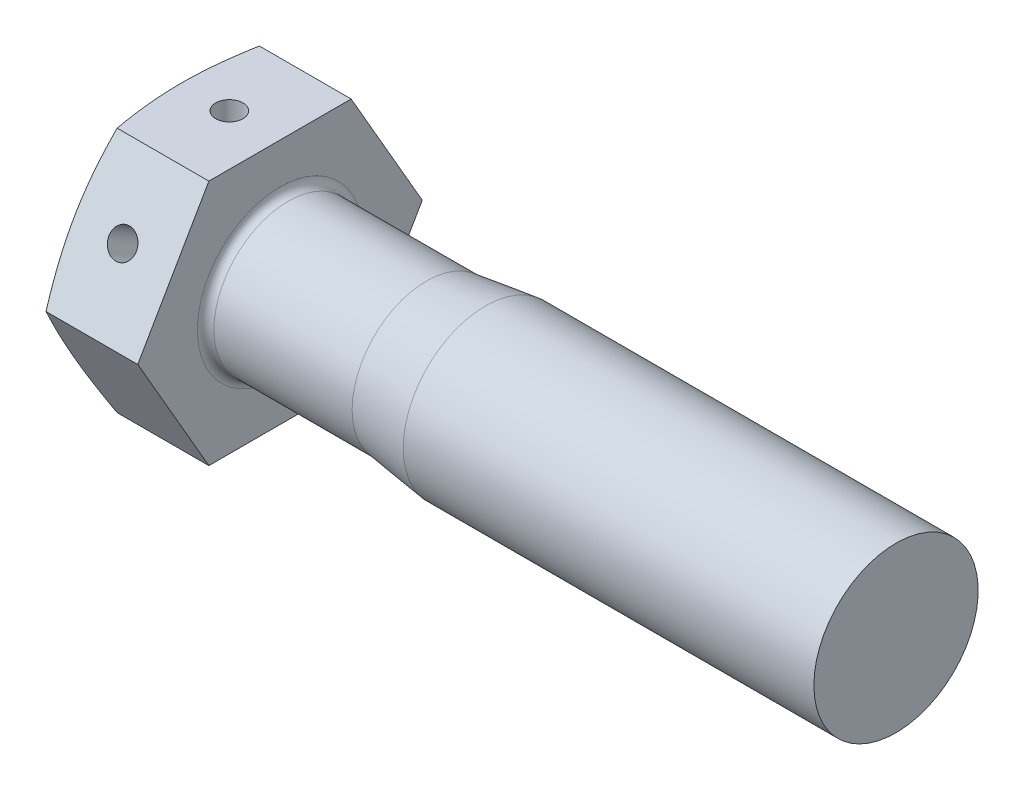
ISO-10303-21;
HEADER;
FILE_DESCRIPTION(('STEP AP214'),'2;1');
FILE_NAME('part.step','',(''),(''),'','','');
FILE_SCHEMA(('AUTOMOTIVE_DESIGN { 1 0 10303 214 1 1 1 1 }'));
ENDSEC;
DATA;
#1=APPLICATION_CONTEXT('core data for automotive mechanical design processes');
#2=APPLICATION_PROTOCOL_DEFINITION('international standard','automotive_design',2000,#1);
#3=PRODUCT_CONTEXT('',#1,'mechanical');
#4=PRODUCT('Part','Part','',(#3));
#5=PRODUCT_RELATED_PRODUCT_CATEGORY('part','',(#4));
#6=PRODUCT_DEFINITION_FORMATION('','',#4);
#7=PRODUCT_DEFINITION_CONTEXT('part definition',#1,'design');
#8=PRODUCT_DEFINITION('design','',#6,#7);
#9=PRODUCT_DEFINITION_SHAPE('','',#8);
#10=(LENGTH_UNIT() NAMED_UNIT(*) SI_UNIT(.MILLI.,.METRE.));
#11=(NAMED_UNIT(*) PLANE_ANGLE_UNIT() SI_UNIT($,.RADIAN.));
#12=(NAMED_UNIT(*) SI_UNIT($,.STERADIAN.) SOLID_ANGLE_UNIT());
#13=UNCERTAINTY_MEASURE_WITH_UNIT(LENGTH_MEASURE(1.E-05),#10,'distance_accuracy_value','');
#14=(GEOMETRIC_REPRESENTATION_CONTEXT(3) GLOBAL_UNCERTAINTY_ASSIGNED_CONTEXT((#13)) GLOBAL_UNIT_ASSIGNED_CONTEXT((#10,
#11,#12)) REPRESENTATION_CONTEXT('',''));
#15=CARTESIAN_POINT('',(0.,0.,0.));
#16=DIRECTION('',(0.,0.,1.));
#17=DIRECTION('',(1.,0.,0.));
#18=AXIS2_PLACEMENT_3D('',#15,#16,#17);
#19=CARTESIAN_POINT('',(3.8,-9.,0.));
#20=DIRECTION('',(0.,1.,0.));
#21=DIRECTION('',(0.,0.,1.));
#22=AXIS2_PLACEMENT_3D('',#19,#20,#21);
#23=CYLINDRICAL_SURFACE('',#22,1.);
#24=CARTESIAN_POINT('',(3.8,9.00000000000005,0.));
#25=DIRECTION('',(0.,1.,0.));
#26=DIRECTION('',(0.,0.,1.));
#27=AXIS2_PLACEMENT_3D('',#24,#25,#26);
#28=CIRCLE('',#27,1.);
#29=CARTESIAN_POINT('',(3.8,9.00000000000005,1.));
#30=VERTEX_POINT('',#29);
#31=EDGE_CURVE('E267',#30,#30,#28,.T.);
#32=ORIENTED_EDGE('',*,*,#31,.T.);
#33=EDGE_LOOP('',(#32));
#34=FACE_BOUND('',#33,.T.);
#35=CARTESIAN_POINT('',(3.8,0.,0.));
#36=DIRECTION('',(0.,0.500000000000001,-0.866025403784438));
#37=DIRECTION('',(0.,0.866025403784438,0.500000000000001));
#38=AXIS2_PLACEMENT_3D('',#35,#36,#37);
#39=ELLIPSE('',#38,2.,1.);
#40=CARTESIAN_POINT('',(4.8,0.,0.));
#41=VERTEX_POINT('',#40);
#42=CARTESIAN_POINT('',(2.8,0.,0.));
#43=VERTEX_POINT('',#42);
#44=EDGE_CURVE('E46',#41,#43,#39,.F.);
#45=ORIENTED_EDGE('',*,*,#44,.T.);
#46=CARTESIAN_POINT('',(3.8,0.,0.));
#47=DIRECTION('',(0.,0.866025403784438,0.500000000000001));
#48=DIRECTION('',(0.,0.500000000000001,-0.866025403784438));
#49=AXIS2_PLACEMENT_3D('',#46,#47,#48);
#50=ELLIPSE('',#49,1.15470053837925,1.);
#51=EDGE_CURVE('E11',#43,#41,#50,.F.);
#52=ORIENTED_EDGE('',*,*,#51,.T.);
#53=EDGE_LOOP('',(#45,#52));
#54=FACE_BOUND('',#53,.T.);
#55=ADVANCED_FACE('F32',(#34,#54),#23,.F.);
#56=CARTESIAN_POINT('',(7.5,-9.,-5.19615242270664));
#57=DIRECTION('',(0.,0.5,0.866025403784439));
#58=DIRECTION('',(0.,-0.866025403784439,0.5));
#59=AXIS2_PLACEMENT_3D('',#56,#57,#58);
#60=PLANE('',#59);
#61=CARTESIAN_POINT('',(3.8,-4.49999999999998,-7.79422863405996));
#62=DIRECTION('',(0.,0.5,0.866025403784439));
#63=DIRECTION('',(0.,-0.866025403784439,0.5));
#64=AXIS2_PLACEMENT_3D('',#61,#62,#63);
#65=CIRCLE('',#64,1.);
#66=CARTESIAN_POINT('',(3.8,-5.36602540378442,-7.29422863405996));
#67=VERTEX_POINT('',#66);
#68=EDGE_CURVE('E269',#67,#67,#65,.T.);
#69=ORIENTED_EDGE('',*,*,#68,.T.);
#70=EDGE_LOOP('',(#69));
#71=FACE_BOUND('',#70,.T.);
#72=CARTESIAN_POINT('',(0.797975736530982,0.000200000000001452,-10.3924203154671));
#73=CARTESIAN_POINT('',(0.719623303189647,-0.372526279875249,-10.1772266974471));
#74=CARTESIAN_POINT('',(0.648348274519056,-0.746481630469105,-9.96132347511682));
#75=CARTESIAN_POINT('',(0.522950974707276,-1.49682376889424,-9.52811323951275));
#76=CARTESIAN_POINT('',(0.468842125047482,-1.87321222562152,-9.31080526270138));
#77=CARTESIAN_POINT('',(0.381322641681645,-2.62424363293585,-8.87719707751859));
#78=CARTESIAN_POINT('',(0.347721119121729,-2.9988694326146,-8.66090677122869));
#79=CARTESIAN_POINT('',(0.302652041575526,-3.74899707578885,-8.22782037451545));
#80=CARTESIAN_POINT('',(0.291176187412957,-4.12449853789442,-8.0110245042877));
#81=CARTESIAN_POINT('',(0.291176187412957,-4.87550146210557,-7.5774327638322));
#82=CARTESIAN_POINT('',(0.302652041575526,-5.25100292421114,-7.36063689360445));
#83=CARTESIAN_POINT('',(0.347721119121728,-6.0011305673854,-6.92755049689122));
#84=CARTESIAN_POINT('',(0.381322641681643,-6.37575636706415,-6.71126019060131));
#85=CARTESIAN_POINT('',(0.46884212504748,-7.12678777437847,-6.27765200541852));
#86=CARTESIAN_POINT('',(0.522950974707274,-7.50317623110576,-6.06034402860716));
#87=CARTESIAN_POINT('',(0.648348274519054,-8.25351836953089,-5.62713379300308));
#88=CARTESIAN_POINT('',(0.719623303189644,-8.62747372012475,-5.41123057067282));
#89=CARTESIAN_POINT('',(0.797975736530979,-9.0002,-5.1960369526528));
#90=B_SPLINE_CURVE_WITH_KNOTS('',3,(#72,#73,#74,#75,#76,#77,#78,#79,#80,#81,#82,#83,#84,#85,#86,
#87,#88,#89),.UNSPECIFIED.,.F.,.F.,(4,2,2,2,2,2,2,2,4),(0.,1.3125188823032,2.62606145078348,
3.92718284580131,5.22781610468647,6.52844936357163,7.82957075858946,9.14311332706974,
10.4556322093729),.UNSPECIFIED.);
#91=CARTESIAN_POINT('',(0.797933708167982,0.,-10.3923048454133));
#92=VERTEX_POINT('',#91);
#93=CARTESIAN_POINT('',(0.79793370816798,-9.,-5.19615242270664));
#94=VERTEX_POINT('',#93);
#95=EDGE_CURVE('E54',#92,#94,#90,.T.);
#96=ORIENTED_EDGE('',*,*,#95,.F.);
#97=DIRECTION('',(-1.,0.,0.));
#98=VECTOR('',#97,1.);
#99=CARTESIAN_POINT('',(7.5,0.,-10.3923048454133));
#100=LINE('',#99,#98);
#101=CARTESIAN_POINT('',(7.5,0.,-10.3923048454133));
#102=VERTEX_POINT('',#101);
#103=EDGE_CURVE('E111',#102,#92,#100,.T.);
#104=ORIENTED_EDGE('',*,*,#103,.F.);
#105=DIRECTION('',(0.,0.866025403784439,-0.5));
#106=VECTOR('',#105,1.);
#107=CARTESIAN_POINT('',(7.5,-9.,-5.19615242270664));
#108=LINE('',#107,#106);
#109=CARTESIAN_POINT('',(7.5,-9.,-5.19615242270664));
#110=VERTEX_POINT('',#109);
#111=EDGE_CURVE('E139',#110,#102,#108,.T.);
#112=ORIENTED_EDGE('',*,*,#111,.F.);
#113=DIRECTION('',(-1.,0.,0.));
#114=VECTOR('',#113,1.);
#115=CARTESIAN_POINT('',(7.5,-9.,-5.19615242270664));
#116=LINE('',#115,#114);
#117=EDGE_CURVE('E126',#110,#94,#116,.T.);
#118=ORIENTED_EDGE('',*,*,#117,.T.);
#119=EDGE_LOOP('',(#96,#104,#112,#118));
#120=FACE_BOUND('',#119,.T.);
#121=ADVANCED_FACE('F34',(#71,#120),#60,.F.);
#122=CARTESIAN_POINT('',(7.5,0.,-10.3923048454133));
#123=DIRECTION('',(0.,-0.5,0.866025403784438));
#124=DIRECTION('',(0.,-0.866025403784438,-0.5));
#125=AXIS2_PLACEMENT_3D('',#122,#123,#124);
#126=PLANE('',#125);
#127=CARTESIAN_POINT('',(0.797975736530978,9.0002,-5.19603695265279));
#128=CARTESIAN_POINT('',(0.719623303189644,8.62747372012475,-5.41123057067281));
#129=CARTESIAN_POINT('',(0.648348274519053,8.25351836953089,-5.62713379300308));
#130=CARTESIAN_POINT('',(0.522950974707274,7.50317623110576,-6.06034402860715));
#131=CARTESIAN_POINT('',(0.468842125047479,7.12678777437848,-6.27765200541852));
#132=CARTESIAN_POINT('',(0.381322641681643,6.37575636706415,-6.7112601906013));
#133=CARTESIAN_POINT('',(0.347721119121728,6.0011305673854,-6.92755049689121));
#134=CARTESIAN_POINT('',(0.302652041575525,5.25100292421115,-7.36063689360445));
#135=CARTESIAN_POINT('',(0.291176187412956,4.87550146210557,-7.5774327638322));
#136=CARTESIAN_POINT('',(0.291176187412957,4.12449853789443,-8.0110245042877));
#137=CARTESIAN_POINT('',(0.302652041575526,3.74899707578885,-8.22782037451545));
#138=CARTESIAN_POINT('',(0.347721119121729,2.9988694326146,-8.66090677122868));
#139=CARTESIAN_POINT('',(0.381322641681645,2.62424363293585,-8.87719707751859));
#140=CARTESIAN_POINT('',(0.468842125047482,1.87321222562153,-9.31080526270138));
#141=CARTESIAN_POINT('',(0.522950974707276,1.49682376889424,-9.52811323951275));
#142=CARTESIAN_POINT('',(0.648348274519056,0.746481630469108,-9.96132347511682));
#143=CARTESIAN_POINT('',(0.719623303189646,0.372526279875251,-10.1772266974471));
#144=CARTESIAN_POINT('',(0.797975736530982,-0.000199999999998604,-10.3924203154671));
#145=B_SPLINE_CURVE_WITH_KNOTS('',3,(#127,#128,#129,#130,#131,#132,#133,#134,#135,#136,#137,
#138,#139,#140,#141,#142,#143,#144),.UNSPECIFIED.,.F.,.F.,(4,2,2,2,2,2,2,2,4),(0.,
1.3125188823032,2.62606145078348,3.92718284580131,5.22781610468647,6.52844936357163,
7.82957075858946,9.14311332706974,10.4556322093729),.UNSPECIFIED.);
#146=CARTESIAN_POINT('',(0.797933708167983,9.,-5.19615242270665));
#147=VERTEX_POINT('',#146);
#148=EDGE_CURVE('E150',#147,#92,#145,.T.);
#149=ORIENTED_EDGE('',*,*,#148,.F.);
#150=DIRECTION('',(-1.,0.,0.));
#151=VECTOR('',#150,1.);
#152=CARTESIAN_POINT('',(7.5,9.,-5.19615242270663));
#153=LINE('',#152,#151);
#154=CARTESIAN_POINT('',(7.5,9.,-5.19615242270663));
#155=VERTEX_POINT('',#154);
#156=EDGE_CURVE('E114',#155,#147,#153,.T.);
#157=ORIENTED_EDGE('',*,*,#156,.F.);
#158=DIRECTION('',(0.,0.866025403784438,0.5));
#159=VECTOR('',#158,1.);
#160=CARTESIAN_POINT('',(7.5,0.,-10.3923048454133));
#161=LINE('',#160,#159);
#162=EDGE_CURVE('E137',#102,#155,#161,.T.);
#163=ORIENTED_EDGE('',*,*,#162,.F.);
#164=ORIENTED_EDGE('',*,*,#103,.T.);
#165=EDGE_LOOP('',(#149,#157,#163,#164));
#166=FACE_BOUND('',#165,.T.);
#167=ADVANCED_FACE('F200',(#166),#126,.F.);
#168=CARTESIAN_POINT('',(7.5,9.,-5.19615242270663));
#169=DIRECTION('',(0.,-1.,0.));
#170=DIRECTION('',(0.,0.,-1.));
#171=AXIS2_PLACEMENT_3D('',#168,#169,#170);
#172=PLANE('',#171);
#173=ORIENTED_EDGE('',*,*,#31,.F.);
#174=EDGE_LOOP('',(#173));
#175=FACE_BOUND('',#174,.T.);
#176=CARTESIAN_POINT('',(2.99064695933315,9.,-13.7298648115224));
#177=CARTESIAN_POINT('',(2.86681811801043,9.,-13.3229547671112));
#178=CARTESIAN_POINT('',(2.74444035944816,9.,-12.9155948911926));
#179=CARTESIAN_POINT('',(2.50338984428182,9.,-12.0997465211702));
#180=CARTESIAN_POINT('',(2.384717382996,9.,-11.6912579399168));
#181=CARTESIAN_POINT('',(2.15168119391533,9.,-10.8722179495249));
#182=CARTESIAN_POINT('',(2.03732599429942,9.,-10.461664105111));
#183=CARTESIAN_POINT('',(1.81427035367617,9.,-9.63902527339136));
#184=CARTESIAN_POINT('',(1.70556981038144,9.,-9.22694031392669));
#185=CARTESIAN_POINT('',(1.49653390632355,9.,-8.40611060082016));
#186=CARTESIAN_POINT('',(1.39611119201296,9.,-7.99738820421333));
#187=CARTESIAN_POINT('',(1.20385742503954,9.,-7.17790644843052));
#188=CARTESIAN_POINT('',(1.11202651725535,9.,-6.76714705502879));
#189=CARTESIAN_POINT('',(0.939106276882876,9.,-5.94350445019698));
#190=CARTESIAN_POINT('',(0.858013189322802,9.,-5.5306220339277));
#191=CARTESIAN_POINT('',(0.709045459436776,9.,-4.70246163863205));
#192=CARTESIAN_POINT('',(0.641170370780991,9.,-4.28718374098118));
#193=CARTESIAN_POINT('',(0.52812546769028,9.,-3.5010438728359));
#194=CARTESIAN_POINT('',(0.48126237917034,9.,-3.13042767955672));
#195=CARTESIAN_POINT('',(0.402026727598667,9.,-2.38763662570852));
#196=CARTESIAN_POINT('',(0.369653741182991,9.,-2.01546181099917));
#197=CARTESIAN_POINT('',(0.320957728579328,9.,-1.27030896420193));
#198=CARTESIAN_POINT('',(0.304623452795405,9.,-0.897331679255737));
#199=CARTESIAN_POINT('',(0.288831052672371,9.,-0.151016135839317));
#200=CARTESIAN_POINT('',(0.289372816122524,9.,0.222322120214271));
#201=CARTESIAN_POINT('',(0.30734897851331,9.,0.970502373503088));
#202=CARTESIAN_POINT('',(0.324870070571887,9.,1.34534225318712));
#203=CARTESIAN_POINT('',(0.375999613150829,9.,2.09391368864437));
#204=CARTESIAN_POINT('',(0.40960844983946,9.,2.46764521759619));
#205=CARTESIAN_POINT('',(0.491347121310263,9.,3.21381849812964));
#206=CARTESIAN_POINT('',(0.539489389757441,9.,3.58625886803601));
#207=CARTESIAN_POINT('',(0.648350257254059,9.,4.32927613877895));
#208=CARTESIAN_POINT('',(0.709068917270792,9.,4.69985303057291));
#209=CARTESIAN_POINT('',(0.845019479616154,9.,5.46095124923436));
#210=CARTESIAN_POINT('',(0.920897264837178,9.,5.85135619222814));
#211=CARTESIAN_POINT('',(1.0824187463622,9.,6.63015355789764));
#212=CARTESIAN_POINT('',(1.16806318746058,9.,7.01854582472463));
#213=CARTESIAN_POINT('',(1.34731089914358,9.,7.79359854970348));
#214=CARTESIAN_POINT('',(1.44091650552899,9.,8.18025846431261));
#215=CARTESIAN_POINT('',(1.63455842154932,9.,8.9519467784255));
#216=CARTESIAN_POINT('',(1.73459457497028,9.,9.33697521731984));
#217=CARTESIAN_POINT('',(1.94002323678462,9.,10.1061283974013));
#218=CARTESIAN_POINT('',(2.04542249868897,9.,10.4902513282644));
#219=CARTESIAN_POINT('',(2.2604935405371,9.,11.2572975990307));
#220=CARTESIAN_POINT('',(2.37016533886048,9.,11.6402209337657));
#221=CARTESIAN_POINT('',(2.59299503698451,9.,12.4049775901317));
#222=CARTESIAN_POINT('',(2.70615232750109,9.,12.7868110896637));
#223=CARTESIAN_POINT('',(2.93536874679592,9.,13.5496070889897));
#224=CARTESIAN_POINT('',(3.05142789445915,9.,13.9305695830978));
#225=CARTESIAN_POINT('',(3.4005426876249,9.,15.0637009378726));
#226=CARTESIAN_POINT('',(3.6370911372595,9.,15.8147934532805));
#227=CARTESIAN_POINT('',(4.11685079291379,9.,17.31487684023));
#228=CARTESIAN_POINT('',(4.36006232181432,9.,18.063867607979));
#229=CARTESIAN_POINT('',(4.85043402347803,9.,19.5573981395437));
#230=CARTESIAN_POINT('',(5.09757565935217,9.,20.3019439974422));
#231=CARTESIAN_POINT('',(5.47101079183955,9.,21.4178157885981));
#232=CARTESIAN_POINT('',(5.59593784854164,9.,21.7896002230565));
#233=CARTESIAN_POINT('',(5.84659472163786,9.,22.5328974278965));
#234=CARTESIAN_POINT('',(5.9723245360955,9.,22.9044101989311));
#235=CARTESIAN_POINT('',(6.0984020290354,9.,23.2758050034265));
#236=B_SPLINE_CURVE_WITH_KNOTS('',3,(#176,#177,#178,#179,#180,#181,#182,#183,#184,#185,#186,
#187,#188,#189,#190,#191,#192,#193,#194,#195,#196,#197,#198,#199,#200,#201,#202,#203,#204,#205,
#206,#207,#208,#209,#210,#211,#212,#213,#214,#215,#216,#217,#218,#219,#220,#221,#222,#223,#224,
#225,#226,#227,#228,#229,#230,#231,#232,#233,#234,#235),.UNSPECIFIED.,.F.,.F.,(4,2,2,2,2,2,2,2,
2,2,2,2,2,2,2,2,2,2,2,2,2,2,2,2,2,2,2,2,2,4),(0.,1.27601235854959,2.55212615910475,
3.83064128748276,5.10913328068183,6.37169542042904,7.63427884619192,8.89641957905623,
10.1585176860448,11.2789727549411,12.3993950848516,13.5190309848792,14.6386594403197,
15.7640347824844,16.8894371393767,18.0158050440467,19.1421784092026,20.335155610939,
21.5282238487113,22.7216433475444,23.9150338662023,25.1099662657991,26.3049038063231,
27.4996336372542,28.6943712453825,31.0567042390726,33.4191519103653,35.7726141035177,
36.9492501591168,38.1258833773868),.UNSPECIFIED.);
#237=CARTESIAN_POINT('',(0.797933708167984,9.00000000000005,5.19615242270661));
#238=VERTEX_POINT('',#237);
#239=EDGE_CURVE('E191',#238,#147,#236,.F.);
#240=ORIENTED_EDGE('',*,*,#239,.F.);
#241=DIRECTION('',(-1.,0.,0.));
#242=VECTOR('',#241,1.);
#243=CARTESIAN_POINT('',(7.5,9.,5.19615242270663));
#244=LINE('',#243,#242);
#245=CARTESIAN_POINT('',(7.5,9.,5.19615242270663));
#246=VERTEX_POINT('',#245);
#247=EDGE_CURVE('E117',#246,#238,#244,.T.);
#248=ORIENTED_EDGE('',*,*,#247,.F.);
#249=DIRECTION('',(0.,0.,1.));
#250=VECTOR('',#249,1.);
#251=CARTESIAN_POINT('',(7.5,9.,-5.19615242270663));
#252=LINE('',#251,#250);
#253=EDGE_CURVE('E135',#155,#246,#252,.T.);
#254=ORIENTED_EDGE('',*,*,#253,.F.);
#255=ORIENTED_EDGE('',*,*,#156,.T.);
#256=EDGE_LOOP('',(#240,#248,#254,#255));
#257=FACE_BOUND('',#256,.T.);
#258=ADVANCED_FACE('F196',(#175,#257),#172,.F.);
#259=CARTESIAN_POINT('',(7.5,9.,5.19615242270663));
#260=DIRECTION('',(0.,-0.5,-0.866025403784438));
#261=DIRECTION('',(0.,0.866025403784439,-0.5));
#262=AXIS2_PLACEMENT_3D('',#259,#260,#261);
#263=PLANE('',#262);
#264=CARTESIAN_POINT('',(3.8,4.49999999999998,7.79422863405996));
#265=DIRECTION('',(0.,-0.5,-0.866025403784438));
#266=DIRECTION('',(0.,0.866025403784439,-0.5));
#267=AXIS2_PLACEMENT_3D('',#264,#265,#266);
#268=CIRCLE('',#267,1.);
#269=CARTESIAN_POINT('',(3.8,5.36602540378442,7.29422863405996));
#270=VERTEX_POINT('',#269);
#271=EDGE_CURVE('E272',#270,#270,#268,.T.);
#272=ORIENTED_EDGE('',*,*,#271,.T.);
#273=EDGE_LOOP('',(#272));
#274=FACE_BOUND('',#273,.T.);
#275=CARTESIAN_POINT('',(0.797975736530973,-0.000199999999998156,10.3924203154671));
#276=CARTESIAN_POINT('',(0.719623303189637,0.372526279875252,10.1772266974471));
#277=CARTESIAN_POINT('',(0.648348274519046,0.746481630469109,9.96132347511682));
#278=CARTESIAN_POINT('',(0.522950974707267,1.49682376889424,9.52811323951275));
#279=CARTESIAN_POINT('',(0.468842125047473,1.87321222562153,9.31080526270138));
#280=CARTESIAN_POINT('',(0.381322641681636,2.62424363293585,8.87719707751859));
#281=CARTESIAN_POINT('',(0.34772111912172,2.99886943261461,8.66090677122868));
#282=CARTESIAN_POINT('',(0.302652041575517,3.74899707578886,8.22782037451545));
#283=CARTESIAN_POINT('',(0.291176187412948,4.12449853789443,8.0110245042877));
#284=CARTESIAN_POINT('',(0.291176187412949,4.87550146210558,7.5774327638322));
#285=CARTESIAN_POINT('',(0.302652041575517,5.25100292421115,7.36063689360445));
#286=CARTESIAN_POINT('',(0.347721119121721,6.0011305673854,6.92755049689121));
#287=CARTESIAN_POINT('',(0.381322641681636,6.37575636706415,6.7112601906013));
#288=CARTESIAN_POINT('',(0.468842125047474,7.12678777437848,6.27765200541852));
#289=CARTESIAN_POINT('',(0.522950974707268,7.50317623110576,6.06034402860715));
#290=CARTESIAN_POINT('',(0.648348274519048,8.2535183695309,5.62713379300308));
#291=CARTESIAN_POINT('',(0.71962330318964,8.62747372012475,5.41123057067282));
#292=CARTESIAN_POINT('',(0.797975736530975,9.0002,5.19603695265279));
#293=B_SPLINE_CURVE_WITH_KNOTS('',3,(#275,#276,#277,#278,#279,#280,#281,#282,#283,#284,#285,
#286,#287,#288,#289,#290,#291,#292),.UNSPECIFIED.,.F.,.F.,(4,2,2,2,2,2,2,2,4),(0.,
1.3125188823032,2.62606145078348,3.92718284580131,5.22781610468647,6.52844936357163,
7.82957075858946,9.14311332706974,10.4556322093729),.UNSPECIFIED.);
#294=CARTESIAN_POINT('',(0.797933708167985,0.,10.3923048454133));
#295=VERTEX_POINT('',#294);
#296=EDGE_CURVE('E186',#295,#238,#293,.T.);
#297=ORIENTED_EDGE('',*,*,#296,.F.);
#298=DIRECTION('',(-1.,0.,0.));
#299=VECTOR('',#298,1.);
#300=CARTESIAN_POINT('',(7.5,0.,10.3923048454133));
#301=LINE('',#300,#299);
#302=CARTESIAN_POINT('',(7.5,0.,10.3923048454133));
#303=VERTEX_POINT('',#302);
#304=EDGE_CURVE('E120',#303,#295,#301,.T.);
#305=ORIENTED_EDGE('',*,*,#304,.F.);
#306=DIRECTION('',(0.,-0.866025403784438,0.5));
#307=VECTOR('',#306,1.);
#308=CARTESIAN_POINT('',(7.5,9.,5.19615242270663));
#309=LINE('',#308,#307);
#310=EDGE_CURVE('E133',#246,#303,#309,.T.);
#311=ORIENTED_EDGE('',*,*,#310,.F.);
#312=ORIENTED_EDGE('',*,*,#247,.T.);
#313=EDGE_LOOP('',(#297,#305,#311,#312));
#314=FACE_BOUND('',#313,.T.);
#315=ADVANCED_FACE('F199',(#274,#314),#263,.F.);
#316=CARTESIAN_POINT('',(7.5,0.,10.3923048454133));
#317=DIRECTION('',(0.,0.5,-0.866025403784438));
#318=DIRECTION('',(0.,0.866025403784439,0.5));
#319=AXIS2_PLACEMENT_3D('',#316,#317,#318);
#320=PLANE('',#319);
#321=CARTESIAN_POINT('',(0.797975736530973,-9.0002,5.19603695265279));
#322=CARTESIAN_POINT('',(0.719623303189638,-8.62747372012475,5.41123057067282));
#323=CARTESIAN_POINT('',(0.648348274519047,-8.25351836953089,5.62713379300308));
#324=CARTESIAN_POINT('',(0.522950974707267,-7.50317623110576,6.06034402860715));
#325=CARTESIAN_POINT('',(0.468842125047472,-7.12678777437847,6.27765200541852));
#326=CARTESIAN_POINT('',(0.381322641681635,-6.37575636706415,6.71126019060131));
#327=CARTESIAN_POINT('',(0.34772111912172,-6.00113056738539,6.92755049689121));
#328=CARTESIAN_POINT('',(0.302652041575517,-5.25100292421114,7.36063689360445));
#329=CARTESIAN_POINT('',(0.291176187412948,-4.87550146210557,7.5774327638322));
#330=CARTESIAN_POINT('',(0.291176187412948,-4.12449853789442,8.0110245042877));
#331=CARTESIAN_POINT('',(0.302652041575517,-3.74899707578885,8.22782037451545));
#332=CARTESIAN_POINT('',(0.34772111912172,-2.9988694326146,8.66090677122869));
#333=CARTESIAN_POINT('',(0.381322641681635,-2.62424363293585,8.87719707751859));
#334=CARTESIAN_POINT('',(0.468842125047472,-1.87321222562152,9.31080526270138));
#335=CARTESIAN_POINT('',(0.522950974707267,-1.49682376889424,9.52811323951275));
#336=CARTESIAN_POINT('',(0.648348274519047,-0.746481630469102,9.96132347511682));
#337=CARTESIAN_POINT('',(0.719623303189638,-0.372526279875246,10.1772266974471));
#338=CARTESIAN_POINT('',(0.797975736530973,0.000200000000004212,10.3924203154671));
#339=B_SPLINE_CURVE_WITH_KNOTS('',3,(#321,#322,#323,#324,#325,#326,#327,#328,#329,#330,#331,
#332,#333,#334,#335,#336,#337,#338),.UNSPECIFIED.,.F.,.F.,(4,2,2,2,2,2,2,2,4),(0.,
1.3125188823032,2.62606145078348,3.92718284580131,5.22781610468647,6.52844936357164,
7.82957075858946,9.14311332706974,10.4556322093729),.UNSPECIFIED.);
#340=CARTESIAN_POINT('',(0.797933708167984,-9.,5.19615242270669));
#341=VERTEX_POINT('',#340);
#342=EDGE_CURVE('E179',#341,#295,#339,.T.);
#343=ORIENTED_EDGE('',*,*,#342,.F.);
#344=DIRECTION('',(-1.,0.,0.));
#345=VECTOR('',#344,1.);
#346=CARTESIAN_POINT('',(7.5,-9.,5.19615242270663));
#347=LINE('',#346,#345);
#348=CARTESIAN_POINT('',(7.5,-9.,5.19615242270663));
#349=VERTEX_POINT('',#348);
#350=EDGE_CURVE('E123',#349,#341,#347,.T.);
#351=ORIENTED_EDGE('',*,*,#350,.F.);
#352=DIRECTION('',(0.,-0.866025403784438,-0.5));
#353=VECTOR('',#352,1.);
#354=CARTESIAN_POINT('',(7.5,0.,10.3923048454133));
#355=LINE('',#354,#353);
#356=EDGE_CURVE('E131',#303,#349,#355,.T.);
#357=ORIENTED_EDGE('',*,*,#356,.F.);
#358=ORIENTED_EDGE('',*,*,#304,.T.);
#359=EDGE_LOOP('',(#343,#351,#357,#358));
#360=FACE_BOUND('',#359,.T.);
#361=ADVANCED_FACE('F278',(#360),#320,.F.);
#362=CARTESIAN_POINT('',(7.5,-9.,5.19615242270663));
#363=DIRECTION('',(0.,1.,0.));
#364=DIRECTION('',(0.,0.,1.));
#365=AXIS2_PLACEMENT_3D('',#362,#363,#364);
#366=PLANE('',#365);
#367=CARTESIAN_POINT('',(3.8,-9.,0.));
#368=DIRECTION('',(0.,1.,0.));
#369=DIRECTION('',(0.,0.,1.));
#370=AXIS2_PLACEMENT_3D('',#367,#368,#369);
#371=CIRCLE('',#370,1.);
#372=CARTESIAN_POINT('',(3.8,-9.,1.));
#373=VERTEX_POINT('',#372);
#374=EDGE_CURVE('E264',#373,#373,#371,.T.);
#375=ORIENTED_EDGE('',*,*,#374,.T.);
#376=EDGE_LOOP('',(#375));
#377=FACE_BOUND('',#376,.T.);
#378=CARTESIAN_POINT('',(2.99064695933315,-9.,-13.7298648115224));
#379=CARTESIAN_POINT('',(2.86681811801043,-9.,-13.3229547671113));
#380=CARTESIAN_POINT('',(2.74444035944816,-9.,-12.9155948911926));
#381=CARTESIAN_POINT('',(2.50338984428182,-9.,-12.0997465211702));
#382=CARTESIAN_POINT('',(2.384717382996,-9.,-11.6912579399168));
#383=CARTESIAN_POINT('',(2.15168119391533,-9.,-10.8722179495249));
#384=CARTESIAN_POINT('',(2.03732599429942,-9.,-10.461664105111));
#385=CARTESIAN_POINT('',(1.81427035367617,-9.,-9.63902527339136));
#386=CARTESIAN_POINT('',(1.70556981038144,-9.,-9.2269403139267));
#387=CARTESIAN_POINT('',(1.49653390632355,-9.,-8.40611060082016));
#388=CARTESIAN_POINT('',(1.39611119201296,-9.,-7.99738820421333));
#389=CARTESIAN_POINT('',(1.20385742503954,-9.,-7.17790644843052));
#390=CARTESIAN_POINT('',(1.11202651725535,-9.,-6.76714705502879));
#391=CARTESIAN_POINT('',(0.939106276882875,-9.,-5.94350445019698));
#392=CARTESIAN_POINT('',(0.858013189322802,-9.,-5.53062203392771));
#393=CARTESIAN_POINT('',(0.709045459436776,-9.,-4.70246163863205));
#394=CARTESIAN_POINT('',(0.641170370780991,-9.,-4.28718374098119));
#395=CARTESIAN_POINT('',(0.52812546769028,-9.,-3.5010438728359));
#396=CARTESIAN_POINT('',(0.48126237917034,-9.,-3.13042767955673));
#397=CARTESIAN_POINT('',(0.402026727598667,-9.,-2.38763662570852));
#398=CARTESIAN_POINT('',(0.369653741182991,-9.,-2.01546181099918));
#399=CARTESIAN_POINT('',(0.320957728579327,-9.,-1.27030896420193));
#400=CARTESIAN_POINT('',(0.304623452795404,-9.,-0.897331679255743));
#401=CARTESIAN_POINT('',(0.28883105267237,-9.,-0.151016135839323));
#402=CARTESIAN_POINT('',(0.289372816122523,-9.,0.222322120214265));
#403=CARTESIAN_POINT('',(0.307348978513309,-9.,0.970502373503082));
#404=CARTESIAN_POINT('',(0.324870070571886,-9.,1.34534225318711));
#405=CARTESIAN_POINT('',(0.375999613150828,-9.,2.09391368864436));
#406=CARTESIAN_POINT('',(0.409608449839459,-9.,2.46764521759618));
#407=CARTESIAN_POINT('',(0.491347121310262,-9.,3.21381849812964));
#408=CARTESIAN_POINT('',(0.539489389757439,-9.,3.58625886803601));
#409=CARTESIAN_POINT('',(0.648350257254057,-9.,4.32927613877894));
#410=CARTESIAN_POINT('',(0.70906891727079,-9.,4.6998530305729));
#411=CARTESIAN_POINT('',(0.845019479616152,-9.,5.46095124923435));
#412=CARTESIAN_POINT('',(0.920897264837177,-9.,5.85135619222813));
#413=CARTESIAN_POINT('',(1.0824187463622,-9.,6.63015355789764));
#414=CARTESIAN_POINT('',(1.16806318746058,-9.,7.01854582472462));
#415=CARTESIAN_POINT('',(1.34731089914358,-9.,7.79359854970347));
#416=CARTESIAN_POINT('',(1.44091650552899,-9.,8.18025846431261));
#417=CARTESIAN_POINT('',(1.63455842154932,-9.,8.9519467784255));
#418=CARTESIAN_POINT('',(1.73459457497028,-9.,9.33697521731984));
#419=CARTESIAN_POINT('',(1.94002323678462,-9.,10.1061283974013));
#420=CARTESIAN_POINT('',(2.04542249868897,-9.,10.4902513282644));
#421=CARTESIAN_POINT('',(2.26049354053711,-9.,11.2572975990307));
#422=CARTESIAN_POINT('',(2.37016533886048,-9.,11.6402209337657));
#423=CARTESIAN_POINT('',(2.59299503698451,-9.,12.4049775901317));
#424=CARTESIAN_POINT('',(2.70615232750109,-9.,12.7868110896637));
#425=CARTESIAN_POINT('',(2.93536874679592,-9.,13.5496070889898));
#426=CARTESIAN_POINT('',(3.05142789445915,-9.,13.9305695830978));
#427=CARTESIAN_POINT('',(3.4005426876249,-9.,15.0637009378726));
#428=CARTESIAN_POINT('',(3.6370911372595,-9.,15.8147934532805));
#429=CARTESIAN_POINT('',(4.11685079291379,-9.,17.31487684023));
#430=CARTESIAN_POINT('',(4.36006232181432,-9.,18.063867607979));
#431=CARTESIAN_POINT('',(4.85043402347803,-9.,19.5573981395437));
#432=CARTESIAN_POINT('',(5.09757565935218,-9.,20.3019439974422));
#433=CARTESIAN_POINT('',(5.47101079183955,-9.,21.4178157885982));
#434=CARTESIAN_POINT('',(5.59593784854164,-9.,21.7896002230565));
#435=CARTESIAN_POINT('',(5.84659472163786,-9.,22.5328974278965));
#436=CARTESIAN_POINT('',(5.9723245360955,-9.,22.9044101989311));
#437=CARTESIAN_POINT('',(6.09840202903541,-9.,23.2758050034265));
#438=B_SPLINE_CURVE_WITH_KNOTS('',3,(#378,#379,#380,#381,#382,#383,#384,#385,#386,#387,#388,
#389,#390,#391,#392,#393,#394,#395,#396,#397,#398,#399,#400,#401,#402,#403,#404,#405,#406,#407,
#408,#409,#410,#411,#412,#413,#414,#415,#416,#417,#418,#419,#420,#421,#422,#423,#424,#425,#426,
#427,#428,#429,#430,#431,#432,#433,#434,#435,#436,#437),.UNSPECIFIED.,.F.,.F.,(4,2,2,2,2,2,2,2,
2,2,2,2,2,2,2,2,2,2,2,2,2,2,2,2,2,2,2,2,2,4),(0.,1.27601235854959,2.55212615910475,
3.83064128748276,5.10913328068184,6.37169542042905,7.63427884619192,8.89641957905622,
10.1585176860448,11.2789727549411,12.3993950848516,13.5190309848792,14.6386594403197,
15.7640347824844,16.8894371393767,18.0158050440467,19.1421784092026,20.335155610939,
21.5282238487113,22.7216433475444,23.9150338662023,25.1099662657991,26.3049038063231,
27.4996336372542,28.6943712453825,31.0567042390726,33.4191519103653,35.7726141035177,
36.9492501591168,38.1258833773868),.UNSPECIFIED.);
#439=EDGE_CURVE('E170',#94,#341,#438,.T.);
#440=ORIENTED_EDGE('',*,*,#439,.F.);
#441=ORIENTED_EDGE('',*,*,#117,.F.);
#442=DIRECTION('',(0.,0.,-1.));
#443=VECTOR('',#442,1.);
#444=CARTESIAN_POINT('',(7.5,-9.,5.19615242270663));
#445=LINE('',#444,#443);
#446=EDGE_CURVE('E129',#349,#110,#445,.T.);
#447=ORIENTED_EDGE('',*,*,#446,.F.);
#448=ORIENTED_EDGE('',*,*,#350,.T.);
#449=EDGE_LOOP('',(#440,#441,#447,#448));
#450=FACE_BOUND('',#449,.T.);
#451=ADVANCED_FACE('F298',(#377,#450),#366,.F.);
#452=CARTESIAN_POINT('',(7.5,0.,-10.3923048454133));
#453=DIRECTION('',(1.,0.,0.));
#454=DIRECTION('',(0.,0.,-1.));
#455=AXIS2_PLACEMENT_3D('',#452,#453,#454);
#456=PLANE('',#455);
#457=CARTESIAN_POINT('',(7.5,0.,0.));
#458=DIRECTION('',(1.,0.,0.));
#459=DIRECTION('',(0.,0.,-1.));
#460=AXIS2_PLACEMENT_3D('',#457,#458,#459);
#461=CIRCLE('',#460,6.0315);
#462=CARTESIAN_POINT('',(7.5,0.,-6.0315));
#463=VERTEX_POINT('',#462);
#464=EDGE_CURVE('E108',#463,#463,#461,.F.);
#465=ORIENTED_EDGE('',*,*,#464,.T.);
#466=EDGE_LOOP('',(#465));
#467=FACE_BOUND('',#466,.T.);
#468=ORIENTED_EDGE('',*,*,#111,.T.);
#469=ORIENTED_EDGE('',*,*,#162,.T.);
#470=ORIENTED_EDGE('',*,*,#253,.T.);
#471=ORIENTED_EDGE('',*,*,#310,.T.);
#472=ORIENTED_EDGE('',*,*,#356,.T.);
#473=ORIENTED_EDGE('',*,*,#446,.T.);
#474=EDGE_LOOP('',(#468,#469,#470,#471,#472,#473));
#475=FACE_BOUND('',#474,.T.);
#476=ADVANCED_FACE('F161',(#467,#475),#456,.T.);
#477=CARTESIAN_POINT('',(0.,0.,0.));
#478=DIRECTION('',(1.,0.,0.));
#479=DIRECTION('',(0.,0.,-1.));
#480=AXIS2_PLACEMENT_3D('',#477,#478,#479);
#481=CONICAL_SURFACE('',#480,8.20000000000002,1.22173047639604);
#482=CARTESIAN_POINT('',(0.,0.,0.));
#483=DIRECTION('',(-1.,0.,0.));
#484=DIRECTION('',(0.,0.,1.));
#485=AXIS2_PLACEMENT_3D('',#482,#483,#484);
#486=CIRCLE('',#485,8.20000000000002);
#487=CARTESIAN_POINT('',(0.,0.,8.20000000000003));
#488=VERTEX_POINT('',#487);
#489=EDGE_CURVE('E251',#488,#488,#486,.T.);
#490=ORIENTED_EDGE('',*,*,#489,.F.);
#491=EDGE_LOOP('',(#490));
#492=FACE_BOUND('',#491,.T.);
#493=ORIENTED_EDGE('',*,*,#95,.T.);
#494=ORIENTED_EDGE('',*,*,#439,.T.);
#495=ORIENTED_EDGE('',*,*,#342,.T.);
#496=ORIENTED_EDGE('',*,*,#296,.T.);
#497=ORIENTED_EDGE('',*,*,#239,.T.);
#498=ORIENTED_EDGE('',*,*,#148,.T.);
#499=EDGE_LOOP('',(#493,#494,#495,#496,#497,#498));
#500=FACE_BOUND('',#499,.T.);
#501=ADVANCED_FACE('F155',(#492,#500),#481,.T.);
#502=CARTESIAN_POINT('',(0.,0.,-10.3923048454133));
#503=DIRECTION('',(1.,0.,0.));
#504=DIRECTION('',(0.,0.,-1.));
#505=AXIS2_PLACEMENT_3D('',#502,#503,#504);
#506=PLANE('',#505);
#507=CARTESIAN_POINT('',(0.,0.,0.));
#508=DIRECTION('',(-1.,0.,0.));
#509=DIRECTION('',(0.,0.,1.));
#510=AXIS2_PLACEMENT_3D('',#507,#508,#509);
#511=CIRCLE('',#510,6.85);
#512=CARTESIAN_POINT('',(0.,0.,6.85));
#513=VERTEX_POINT('',#512);
#514=EDGE_CURVE('E252',#513,#513,#511,.T.);
#515=ORIENTED_EDGE('',*,*,#514,.F.);
#516=EDGE_LOOP('',(#515));
#517=FACE_BOUND('',#516,.T.);
#518=ORIENTED_EDGE('',*,*,#489,.T.);
#519=EDGE_LOOP('',(#518));
#520=FACE_BOUND('',#519,.T.);
#521=ADVANCED_FACE('F160',(#517,#520),#506,.F.);
#522=CARTESIAN_POINT('',(1.5,0.,0.));
#523=DIRECTION('',(-1.,0.,0.));
#524=DIRECTION('',(0.,0.,1.));
#525=AXIS2_PLACEMENT_3D('',#522,#523,#524);
#526=CYLINDRICAL_SURFACE('',#525,6.85);
#527=CARTESIAN_POINT('',(1.5,0.,0.));
#528=DIRECTION('',(-1.,0.,0.));
#529=DIRECTION('',(0.,0.,1.));
#530=AXIS2_PLACEMENT_3D('',#527,#528,#529);
#531=CIRCLE('',#530,6.85);
#532=CARTESIAN_POINT('',(1.5,0.,6.85));
#533=VERTEX_POINT('',#532);
#534=EDGE_CURVE('E250',#533,#533,#531,.T.);
#535=ORIENTED_EDGE('',*,*,#534,.F.);
#536=EDGE_LOOP('',(#535));
#537=FACE_BOUND('',#536,.T.);
#538=ORIENTED_EDGE('',*,*,#514,.T.);
#539=EDGE_LOOP('',(#538));
#540=FACE_BOUND('',#539,.T.);
#541=ADVANCED_FACE('F163',(#537,#540),#526,.F.);
#542=CARTESIAN_POINT('',(1.5,0.,0.));
#543=DIRECTION('',(-1.,0.,0.));
#544=DIRECTION('',(0.,0.,1.));
#545=AXIS2_PLACEMENT_3D('',#542,#543,#544);
#546=PLANE('',#545);
#547=ORIENTED_EDGE('',*,*,#534,.T.);
#548=EDGE_LOOP('',(#547));
#549=FACE_BOUND('',#548,.T.);
#550=ADVANCED_FACE('F240',(#549),#546,.T.);
#551=CARTESIAN_POINT('',(18.2,0.,0.));
#552=DIRECTION('',(1.,0.,0.));
#553=DIRECTION('',(0.,0.,-1.));
#554=AXIS2_PLACEMENT_3D('',#551,#552,#553);
#555=CONICAL_SURFACE('',#554,5.4315,0.131446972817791);
#556=CARTESIAN_POINT('',(22.5,0.,0.));
#557=DIRECTION('',(-1.,0.,0.));
#558=DIRECTION('',(0.,0.,1.));
#559=AXIS2_PLACEMENT_3D('',#556,#557,#558);
#560=CIRCLE('',#559,6.);
#561=CARTESIAN_POINT('',(22.5,0.,6.));
#562=VERTEX_POINT('',#561);
#563=EDGE_CURVE('E256',#562,#562,#560,.T.);
#564=ORIENTED_EDGE('',*,*,#563,.T.);
#565=EDGE_LOOP('',(#564));
#566=FACE_BOUND('',#565,.T.);
#567=CARTESIAN_POINT('',(18.2,0.,0.));
#568=DIRECTION('',(-1.,0.,0.));
#569=DIRECTION('',(0.,0.,1.));
#570=AXIS2_PLACEMENT_3D('',#567,#568,#569);
#571=CIRCLE('',#570,5.4315);
#572=CARTESIAN_POINT('',(18.2,0.,5.4315));
#573=VERTEX_POINT('',#572);
#574=EDGE_CURVE('E261',#573,#573,#571,.T.);
#575=ORIENTED_EDGE('',*,*,#574,.F.);
#576=EDGE_LOOP('',(#575));
#577=FACE_BOUND('',#576,.T.);
#578=ADVANCED_FACE('F237',(#566,#577),#555,.T.);
#579=CARTESIAN_POINT('',(-2.69717570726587,0.,0.));
#580=DIRECTION('',(-1.,0.,0.));
#581=DIRECTION('',(0.,0.,1.));
#582=AXIS2_PLACEMENT_3D('',#579,#580,#581);
#583=CYLINDRICAL_SURFACE('',#582,5.4315);
#584=CARTESIAN_POINT('',(8.1,0.,0.));
#585=DIRECTION('',(1.,0.,0.));
#586=DIRECTION('',(0.,0.,-1.));
#587=AXIS2_PLACEMENT_3D('',#584,#585,#586);
#588=CIRCLE('',#587,5.4315);
#589=CARTESIAN_POINT('',(8.1,0.,-5.4315));
#590=VERTEX_POINT('',#589);
#591=EDGE_CURVE('E101',#590,#590,#588,.T.);
#592=ORIENTED_EDGE('',*,*,#591,.T.);
#593=EDGE_LOOP('',(#592));
#594=FACE_BOUND('',#593,.T.);
#595=ORIENTED_EDGE('',*,*,#574,.T.);
#596=EDGE_LOOP('',(#595));
#597=FACE_BOUND('',#596,.T.);
#598=ADVANCED_FACE('F234',(#594,#597),#583,.T.);
#599=CARTESIAN_POINT('',(52.5,0.,0.));
#600=DIRECTION('',(1.,0.,0.));
#601=DIRECTION('',(0.,0.,-1.));
#602=AXIS2_PLACEMENT_3D('',#599,#600,#601);
#603=PLANE('',#602);
#604=CARTESIAN_POINT('',(52.5,0.,0.));
#605=DIRECTION('',(1.,0.,0.));
#606=DIRECTION('',(0.,0.,-1.));
#607=AXIS2_PLACEMENT_3D('',#604,#605,#606);
#608=CIRCLE('',#607,6.);
#609=CARTESIAN_POINT('',(52.5,0.,6.));
#610=VERTEX_POINT('',#609);
#611=EDGE_CURVE('E142',#610,#610,#608,.T.);
#612=ORIENTED_EDGE('',*,*,#611,.T.);
#613=EDGE_LOOP('',(#612));
#614=FACE_BOUND('',#613,.T.);
#615=ADVANCED_FACE('F165',(#614),#603,.T.);
#616=CARTESIAN_POINT('',(52.5,0.,0.));
#617=DIRECTION('',(-1.,0.,0.));
#618=DIRECTION('',(0.,0.,1.));
#619=AXIS2_PLACEMENT_3D('',#616,#617,#618);
#620=CYLINDRICAL_SURFACE('',#619,6.);
#621=CARTESIAN_POINT('',(52.5,0.,6.));
#622=CARTESIAN_POINT('',(52.1875,0.,6.));
#623=CARTESIAN_POINT('',(51.875,0.,6.));
#624=CARTESIAN_POINT('',(51.25,0.,6.));
#625=CARTESIAN_POINT('',(50.9375,0.,6.));
#626=CARTESIAN_POINT('',(50.3125,0.,6.));
#627=CARTESIAN_POINT('',(50.,0.,6.));
#628=CARTESIAN_POINT('',(49.375,0.,6.));
#629=CARTESIAN_POINT('',(49.0625,0.,6.));
#630=CARTESIAN_POINT('',(48.4375,0.,6.));
#631=CARTESIAN_POINT('',(48.125,0.,6.));
#632=CARTESIAN_POINT('',(47.5,0.,6.));
#633=CARTESIAN_POINT('',(47.1875,0.,6.));
#634=CARTESIAN_POINT('',(46.5625,0.,6.));
#635=CARTESIAN_POINT('',(46.25,0.,6.));
#636=CARTESIAN_POINT('',(45.625,0.,6.));
#637=CARTESIAN_POINT('',(45.3125,0.,6.));
#638=CARTESIAN_POINT('',(44.6875,0.,6.));
#639=CARTESIAN_POINT('',(44.375,0.,6.));
#640=CARTESIAN_POINT('',(43.75,0.,6.));
#641=CARTESIAN_POINT('',(43.4375,0.,6.));
#642=CARTESIAN_POINT('',(42.8125,0.,6.));
#643=CARTESIAN_POINT('',(42.5,0.,6.));
#644=CARTESIAN_POINT('',(41.875,0.,6.));
#645=CARTESIAN_POINT('',(41.5625,0.,6.));
#646=CARTESIAN_POINT('',(40.9375,0.,6.));
#647=CARTESIAN_POINT('',(40.625,0.,6.));
#648=CARTESIAN_POINT('',(40.,0.,6.));
#649=CARTESIAN_POINT('',(39.6875,0.,6.));
#650=CARTESIAN_POINT('',(39.0625,0.,6.));
#651=CARTESIAN_POINT('',(38.75,0.,6.));
#652=CARTESIAN_POINT('',(38.125,0.,6.));
#653=CARTESIAN_POINT('',(37.8125,0.,6.));
#654=CARTESIAN_POINT('',(37.1875,0.,6.));
#655=CARTESIAN_POINT('',(36.875,0.,6.));
#656=CARTESIAN_POINT('',(36.25,0.,6.));
#657=CARTESIAN_POINT('',(35.9375,0.,6.));
#658=CARTESIAN_POINT('',(35.3125,0.,6.));
#659=CARTESIAN_POINT('',(35.,0.,6.));
#660=CARTESIAN_POINT('',(34.375,0.,6.));
#661=CARTESIAN_POINT('',(34.0625,0.,6.));
#662=CARTESIAN_POINT('',(33.4375,0.,6.));
#663=CARTESIAN_POINT('',(33.125,0.,6.));
#664=CARTESIAN_POINT('',(32.5,0.,6.));
#665=CARTESIAN_POINT('',(32.1875,0.,6.));
#666=CARTESIAN_POINT('',(31.5625,0.,6.));
#667=CARTESIAN_POINT('',(31.25,0.,6.));
#668=CARTESIAN_POINT('',(30.625,0.,6.));
#669=CARTESIAN_POINT('',(30.3125,0.,6.));
#670=CARTESIAN_POINT('',(29.6875,0.,6.));
#671=CARTESIAN_POINT('',(29.375,0.,6.));
#672=CARTESIAN_POINT('',(28.75,0.,6.));
#673=CARTESIAN_POINT('',(28.4375,0.,6.));
#674=CARTESIAN_POINT('',(27.8125,0.,6.));
#675=CARTESIAN_POINT('',(27.5,0.,6.));
#676=CARTESIAN_POINT('',(26.875,0.,6.));
#677=CARTESIAN_POINT('',(26.5625,0.,6.));
#678=CARTESIAN_POINT('',(25.9375,0.,6.));
#679=CARTESIAN_POINT('',(25.625,0.,6.));
#680=CARTESIAN_POINT('',(25.,0.,6.));
#681=CARTESIAN_POINT('',(24.6875,0.,6.));
#682=CARTESIAN_POINT('',(24.0625,0.,6.));
#683=CARTESIAN_POINT('',(23.75,0.,6.));
#684=CARTESIAN_POINT('',(23.125,0.,6.));
#685=CARTESIAN_POINT('',(22.8125,0.,6.));
#686=CARTESIAN_POINT('',(22.5,0.,6.));
#687=B_SPLINE_CURVE_WITH_KNOTS('',3,(#621,#622,#623,#624,#625,#626,#627,#628,#629,#630,#631,
#632,#633,#634,#635,#636,#637,#638,#639,#640,#641,#642,#643,#644,#645,#646,#647,#648,#649,#650,
#651,#652,#653,#654,#655,#656,#657,#658,#659,#660,#661,#662,#663,#664,#665,#666,#667,#668,#669,
#670,#671,#672,#673,#674,#675,#676,#677,#678,#679,#680,#681,#682,#683,#684,#685,#686),
.UNSPECIFIED.,.F.,.F.,(4,2,2,2,2,2,2,2,2,2,2,2,2,2,2,2,2,2,2,2,2,2,2,2,2,2,2,2,2,2,2,2,4),(0.,
0.937499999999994,1.87499999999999,2.8125,3.75,4.6875,5.62499999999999,6.56249999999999,
7.49999999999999,8.43749999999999,9.37499999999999,10.3125,11.25,12.1875,13.125,14.0625,15.,
15.9375,16.875,17.8125,18.75,19.6875,20.625,21.5625,22.5,23.4375,24.375,25.3125,26.25,27.1875,
28.125,29.0625,30.),.UNSPECIFIED.);
#688=EDGE_CURVE('BSEAM225',#610,#562,#687,.T.);
#689=ORIENTED_EDGE('',*,*,#611,.F.);
#690=ORIENTED_EDGE('',*,*,#563,.F.);
#691=ORIENTED_EDGE('',*,*,#688,.T.);
#692=ORIENTED_EDGE('',*,*,#688,.F.);
#693=EDGE_LOOP('',(#689,#691,#690,#692));
#694=FACE_BOUND('',#693,.T.);
#695=ADVANCED_FACE('F225',(#694),#620,.T.);
#696=CARTESIAN_POINT('',(8.1,0.,0.));
#697=DIRECTION('',(1.,0.,0.));
#698=DIRECTION('',(0.,0.,-1.));
#699=AXIS2_PLACEMENT_3D('',#696,#697,#698);
#700=TOROIDAL_SURFACE('',#699,6.0315,0.6);
#701=ORIENTED_EDGE('',*,*,#591,.F.);
#702=EDGE_LOOP('',(#701));
#703=FACE_BOUND('',#702,.T.);
#704=ORIENTED_EDGE('',*,*,#464,.F.);
#705=EDGE_LOOP('',(#704));
#706=FACE_BOUND('',#705,.T.);
#707=ADVANCED_FACE('F220',(#703,#706),#700,.F.);
#708=CARTESIAN_POINT('',(3.8,0.,0.));
#709=DIRECTION('',(0.,0.500000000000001,-0.866025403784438));
#710=DIRECTION('',(0.,0.866025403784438,0.500000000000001));
#711=AXIS2_PLACEMENT_3D('',#708,#709,#710);
#712=ELLIPSE('',#711,2.,1.);
#713=EDGE_CURVE('E92',#41,#43,#712,.T.);
#714=ORIENTED_EDGE('',*,*,#713,.T.);
#715=CARTESIAN_POINT('',(3.8,0.,0.));
#716=DIRECTION('',(0.,0.866025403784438,0.500000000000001));
#717=DIRECTION('',(0.,0.500000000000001,-0.866025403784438));
#718=AXIS2_PLACEMENT_3D('',#715,#716,#717);
#719=ELLIPSE('',#718,1.15470053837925,1.);
#720=EDGE_CURVE('E41',#43,#41,#719,.T.);
#721=ORIENTED_EDGE('',*,*,#720,.T.);
#722=EDGE_LOOP('',(#714,#721));
#723=FACE_BOUND('',#722,.T.);
#724=ORIENTED_EDGE('',*,*,#374,.F.);
#725=EDGE_LOOP('',(#724));
#726=FACE_BOUND('',#725,.T.);
#727=ADVANCED_FACE('F103',(#723,#726),#23,.F.);
#728=CARTESIAN_POINT('',(3.8,-6.74999999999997,-11.6913429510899));
#729=DIRECTION('',(0.,0.499999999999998,0.86602540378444));
#730=DIRECTION('',(0.,-0.86602540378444,0.499999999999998));
#731=AXIS2_PLACEMENT_3D('',#728,#729,#730);
#732=CYLINDRICAL_SURFACE('',#731,1.);
#733=ORIENTED_EDGE('',*,*,#44,.F.);
#734=ORIENTED_EDGE('',*,*,#720,.F.);
#735=EDGE_LOOP('',(#733,#734));
#736=FACE_BOUND('',#735,.T.);
#737=ORIENTED_EDGE('',*,*,#271,.F.);
#738=EDGE_LOOP('',(#737));
#739=FACE_BOUND('',#738,.T.);
#740=ADVANCED_FACE('F99',(#736,#739),#732,.F.);
#741=ORIENTED_EDGE('',*,*,#713,.F.);
#742=ORIENTED_EDGE('',*,*,#51,.F.);
#743=EDGE_LOOP('',(#741,#742));
#744=FACE_BOUND('',#743,.T.);
#745=ORIENTED_EDGE('',*,*,#68,.F.);
#746=EDGE_LOOP('',(#745));
#747=FACE_BOUND('',#746,.T.);
#748=ADVANCED_FACE('F93',(#744,#747),#732,.F.);
#749=CLOSED_SHELL('',(#55,#121,#167,#258,#315,#361,#451,#476,#501,#521,#541,#550,#578,#598,#615,
#695,#707,#727,#740,#748));
#750=MANIFOLD_SOLID_BREP('B2',#749);
#751=ADVANCED_BREP_SHAPE_REPRESENTATION('',(#18,#750),#14);
#752=SHAPE_DEFINITION_REPRESENTATION(#9,#751);
ENDSEC;
END-ISO-10303-21;
